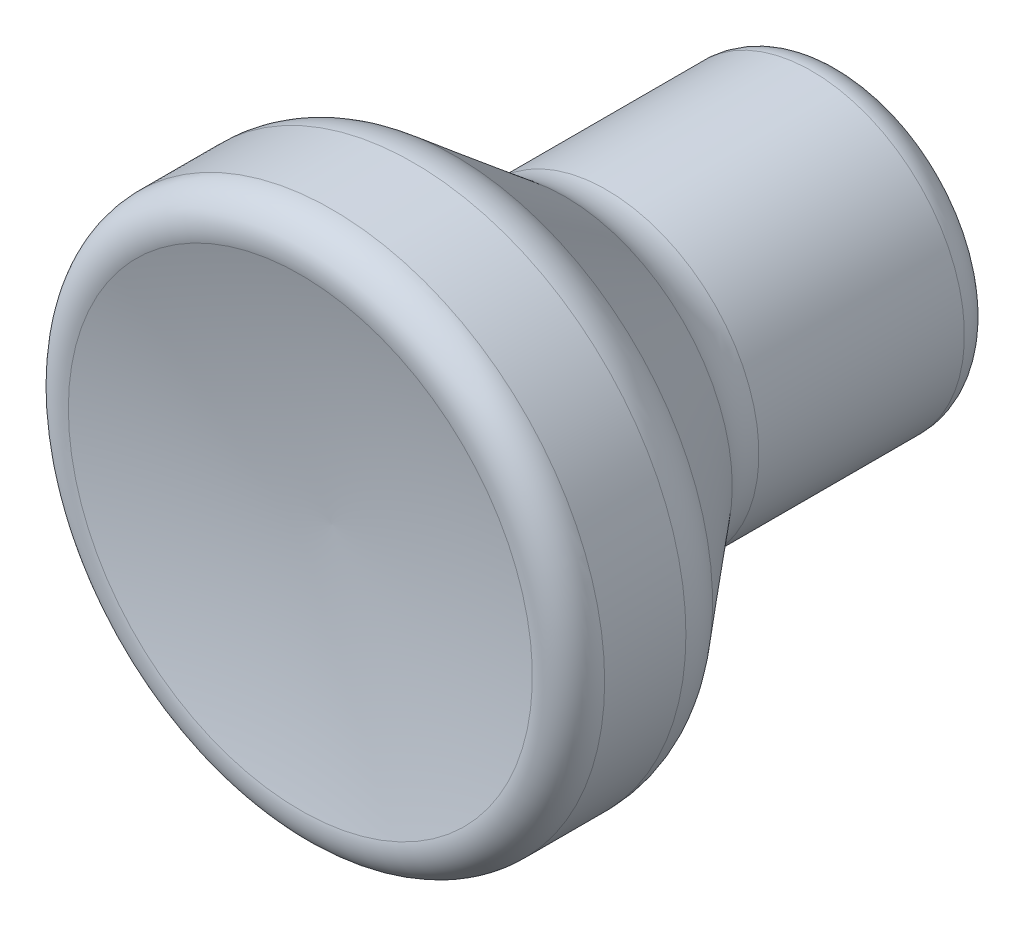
ISO-10303-21;
HEADER;
FILE_DESCRIPTION(('STEP AP214'),'2;1');
FILE_NAME('part.step','',(''),(''),'','','');
FILE_SCHEMA(('AUTOMOTIVE_DESIGN { 1 0 10303 214 1 1 1 1 }'));
ENDSEC;
DATA;
#1=APPLICATION_CONTEXT('core data for automotive mechanical design processes');
#2=APPLICATION_PROTOCOL_DEFINITION('international standard','automotive_design',2000,#1);
#3=PRODUCT_CONTEXT('',#1,'mechanical');
#4=PRODUCT('Part','Part','',(#3));
#5=PRODUCT_RELATED_PRODUCT_CATEGORY('part','',(#4));
#6=PRODUCT_DEFINITION_FORMATION('','',#4);
#7=PRODUCT_DEFINITION_CONTEXT('part definition',#1,'design');
#8=PRODUCT_DEFINITION('design','',#6,#7);
#9=PRODUCT_DEFINITION_SHAPE('','',#8);
#10=(LENGTH_UNIT() NAMED_UNIT(*) SI_UNIT(.MILLI.,.METRE.));
#11=(NAMED_UNIT(*) PLANE_ANGLE_UNIT() SI_UNIT($,.RADIAN.));
#12=(NAMED_UNIT(*) SI_UNIT($,.STERADIAN.) SOLID_ANGLE_UNIT());
#13=UNCERTAINTY_MEASURE_WITH_UNIT(LENGTH_MEASURE(1.E-05),#10,'distance_accuracy_value','');
#14=(GEOMETRIC_REPRESENTATION_CONTEXT(3) GLOBAL_UNCERTAINTY_ASSIGNED_CONTEXT((#13)) GLOBAL_UNIT_ASSIGNED_CONTEXT((#10,
#11,#12)) REPRESENTATION_CONTEXT('',''));
#15=CARTESIAN_POINT('',(0.,0.,0.));
#16=DIRECTION('',(0.,0.,1.));
#17=DIRECTION('',(1.,0.,0.));
#18=AXIS2_PLACEMENT_3D('',#15,#16,#17);
#19=CARTESIAN_POINT('',(0.000233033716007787,0.,23.5179137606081));
#20=DIRECTION('',(0.,0.,1.));
#21=DIRECTION('',(-1.,0.,0.));
#22=AXIS2_PLACEMENT_3D('',#19,#20,#21);
#23=CYLINDRICAL_SURFACE('',#22,3.);
#24=CARTESIAN_POINT('',(0.000233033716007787,0.,0.449887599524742));
#25=DIRECTION('',(0.,0.,-1.));
#26=DIRECTION('',(-1.,0.,0.));
#27=AXIS2_PLACEMENT_3D('',#24,#25,#26);
#28=CIRCLE('',#27,3.);
#29=CARTESIAN_POINT('',(-2.99976696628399,0.,0.449887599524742));
#30=VERTEX_POINT('',#29);
#31=EDGE_CURVE('E9',#30,#30,#28,.T.);
#32=ORIENTED_EDGE('',*,*,#31,.T.);
#33=EDGE_LOOP('',(#32));
#34=FACE_BOUND('',#33,.T.);
#35=CARTESIAN_POINT('',(0.000233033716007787,0.,9.99988759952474));
#36=DIRECTION('',(0.,0.,-1.));
#37=DIRECTION('',(-1.,0.,0.));
#38=AXIS2_PLACEMENT_3D('',#35,#36,#37);
#39=CIRCLE('',#38,3.);
#40=CARTESIAN_POINT('',(-2.99976696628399,0.,9.99988759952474));
#41=VERTEX_POINT('',#40);
#42=EDGE_CURVE('E105',#41,#41,#39,.T.);
#43=ORIENTED_EDGE('',*,*,#42,.F.);
#44=EDGE_LOOP('',(#43));
#45=FACE_BOUND('',#44,.T.);
#46=ADVANCED_FACE('F14',(#34,#45),#23,.F.);
#47=CARTESIAN_POINT('',(0.000233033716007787,0.,0.));
#48=DIRECTION('',(0.,0.,1.));
#49=DIRECTION('',(-1.,0.,0.));
#50=AXIS2_PLACEMENT_3D('',#47,#48,#49);
#51=CONICAL_SURFACE('',#50,5.49991569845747,1.57075136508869);
#52=CARTESIAN_POINT('',(0.000233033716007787,0.,-9.2168617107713E-05));
#53=DIRECTION('',(0.,0.,-1.));
#54=DIRECTION('',(-1.,0.,0.));
#55=AXIS2_PLACEMENT_3D('',#52,#53,#54);
#56=CIRCLE('',#55,3.44997976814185);
#57=CARTESIAN_POINT('',(-3.44974673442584,0.,-9.2168617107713E-05));
#58=VERTEX_POINT('',#57);
#59=EDGE_CURVE('E21',#58,#58,#56,.F.);
#60=ORIENTED_EDGE('',*,*,#59,.T.);
#61=EDGE_LOOP('',(#60));
#62=FACE_BOUND('',#61,.T.);
#63=CARTESIAN_POINT('',(0.000233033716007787,0.,0.));
#64=DIRECTION('',(0.,0.,1.));
#65=DIRECTION('',(-1.,0.,0.));
#66=AXIS2_PLACEMENT_3D('',#63,#64,#65);
#67=CIRCLE('',#66,5.49991569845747);
#68=CARTESIAN_POINT('',(-5.49968266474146,0.,0.));
#69=VERTEX_POINT('',#68);
#70=EDGE_CURVE('E102',#69,#69,#67,.T.);
#71=ORIENTED_EDGE('',*,*,#70,.F.);
#72=EDGE_LOOP('',(#71));
#73=FACE_BOUND('',#72,.T.);
#74=ADVANCED_FACE('F43',(#62,#73),#51,.T.);
#75=CARTESIAN_POINT('',(0.000233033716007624,0.,1.5));
#76=DIRECTION('',(0.,0.,1.));
#77=DIRECTION('',(-1.,0.,0.));
#78=AXIS2_PLACEMENT_3D('',#75,#76,#77);
#79=TOROIDAL_SURFACE('',#78,5.49991569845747,1.5);
#80=ORIENTED_EDGE('',*,*,#70,.T.);
#81=EDGE_LOOP('',(#80));
#82=FACE_BOUND('',#81,.T.);
#83=CARTESIAN_POINT('',(0.000233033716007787,0.,1.5));
#84=DIRECTION('',(0.,0.,1.));
#85=DIRECTION('',(-1.,0.,0.));
#86=AXIS2_PLACEMENT_3D('',#83,#84,#85);
#87=CIRCLE('',#86,6.99991569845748);
#88=CARTESIAN_POINT('',(-6.99968266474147,0.,1.5));
#89=VERTEX_POINT('',#88);
#90=EDGE_CURVE('E99',#89,#89,#87,.T.);
#91=ORIENTED_EDGE('',*,*,#90,.F.);
#92=EDGE_LOOP('',(#91));
#93=FACE_BOUND('',#92,.T.);
#94=ADVANCED_FACE('F49',(#82,#93),#79,.T.);
#95=CARTESIAN_POINT('',(0.000233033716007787,0.,23.5179137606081));
#96=DIRECTION('',(0.,0.,1.));
#97=DIRECTION('',(-1.,0.,0.));
#98=AXIS2_PLACEMENT_3D('',#95,#96,#97);
#99=CYLINDRICAL_SURFACE('',#98,6.99991569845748);
#100=ORIENTED_EDGE('',*,*,#90,.T.);
#101=EDGE_LOOP('',(#100));
#102=FACE_BOUND('',#101,.T.);
#103=CARTESIAN_POINT('',(0.000233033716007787,0.,10.9264));
#104=DIRECTION('',(0.,0.,1.));
#105=DIRECTION('',(-1.,0.,0.));
#106=AXIS2_PLACEMENT_3D('',#103,#104,#105);
#107=CIRCLE('',#106,6.99991569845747);
#108=CARTESIAN_POINT('',(-6.99968266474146,0.,10.9264));
#109=VERTEX_POINT('',#108);
#110=EDGE_CURVE('E96',#109,#109,#107,.T.);
#111=ORIENTED_EDGE('',*,*,#110,.F.);
#112=EDGE_LOOP('',(#111));
#113=FACE_BOUND('',#112,.T.);
#114=ADVANCED_FACE('F56',(#102,#113),#99,.T.);
#115=CARTESIAN_POINT('',(0.000233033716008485,0.,10.9263360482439));
#116=DIRECTION('',(0.,0.,1.));
#117=DIRECTION('',(-1.,0.,0.));
#118=AXIS2_PLACEMENT_3D('',#115,#116,#117);
#119=TOROIDAL_SURFACE('',#118,9.99992190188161,3.00000620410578);
#120=ORIENTED_EDGE('',*,*,#110,.T.);
#121=EDGE_LOOP('',(#120));
#122=FACE_BOUND('',#121,.T.);
#123=CARTESIAN_POINT('',(0.000233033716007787,0.,12.8298));
#124=DIRECTION('',(0.,0.,1.));
#125=DIRECTION('',(-1.,0.,0.));
#126=AXIS2_PLACEMENT_3D('',#123,#124,#125);
#127=CIRCLE('',#126,7.68111569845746);
#128=CARTESIAN_POINT('',(-7.68088266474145,0.,12.8298));
#129=VERTEX_POINT('',#128);
#130=EDGE_CURVE('E93',#129,#129,#127,.T.);
#131=ORIENTED_EDGE('',*,*,#130,.F.);
#132=EDGE_LOOP('',(#131));
#133=FACE_BOUND('',#132,.T.);
#134=ADVANCED_FACE('F60',(#122,#133),#119,.F.);
#135=CARTESIAN_POINT('',(0.000233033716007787,0.,17.8702153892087));
#136=DIRECTION('',(0.,0.,1.));
#137=DIRECTION('',(-1.,0.,0.));
#138=AXIS2_PLACEMENT_3D('',#135,#136,#137);
#139=CONICAL_SURFACE('',#138,11.8186969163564,0.687344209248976);
#140=ORIENTED_EDGE('',*,*,#130,.T.);
#141=EDGE_LOOP('',(#140));
#142=FACE_BOUND('',#141,.T.);
#143=CARTESIAN_POINT('',(0.000233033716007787,0.,17.8702153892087));
#144=DIRECTION('',(0.,0.,1.));
#145=DIRECTION('',(-1.,0.,0.));
#146=AXIS2_PLACEMENT_3D('',#143,#144,#145);
#147=CIRCLE('',#146,11.8186969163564);
#148=CARTESIAN_POINT('',(-11.8184638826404,0.,17.8702153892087));
#149=VERTEX_POINT('',#148);
#150=EDGE_CURVE('E87',#149,#149,#147,.T.);
#151=ORIENTED_EDGE('',*,*,#150,.F.);
#152=EDGE_LOOP('',(#151));
#153=FACE_BOUND('',#152,.T.);
#154=ADVANCED_FACE('F64',(#142,#153),#139,.T.);
#155=CARTESIAN_POINT('',(0.000233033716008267,0.,19.7737));
#156=DIRECTION('',(0.,0.,1.));
#157=DIRECTION('',(-1.,0.,0.));
#158=AXIS2_PLACEMENT_3D('',#155,#156,#157);
#159=TOROIDAL_SURFACE('',#158,9.49991569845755,2.99999999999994);
#160=ORIENTED_EDGE('',*,*,#150,.T.);
#161=EDGE_LOOP('',(#160));
#162=FACE_BOUND('',#161,.T.);
#163=CARTESIAN_POINT('',(0.000233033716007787,0.,19.7737));
#164=DIRECTION('',(0.,0.,1.));
#165=DIRECTION('',(-1.,0.,0.));
#166=AXIS2_PLACEMENT_3D('',#163,#164,#165);
#167=CIRCLE('',#166,12.4999156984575);
#168=CARTESIAN_POINT('',(-12.4996826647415,0.,19.7737));
#169=VERTEX_POINT('',#168);
#170=EDGE_CURVE('E81',#169,#169,#167,.T.);
#171=ORIENTED_EDGE('',*,*,#170,.F.);
#172=EDGE_LOOP('',(#171));
#173=FACE_BOUND('',#172,.T.);
#174=ADVANCED_FACE('F68',(#162,#173),#159,.T.);
#175=CARTESIAN_POINT('',(0.000233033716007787,0.,23.5179137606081));
#176=DIRECTION('',(0.,0.,1.));
#177=DIRECTION('',(-1.,0.,0.));
#178=AXIS2_PLACEMENT_3D('',#175,#176,#177);
#179=CYLINDRICAL_SURFACE('',#178,12.4999156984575);
#180=ORIENTED_EDGE('',*,*,#170,.T.);
#181=EDGE_LOOP('',(#180));
#182=FACE_BOUND('',#181,.T.);
#183=CARTESIAN_POINT('',(0.000233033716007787,0.,23.5));
#184=DIRECTION('',(0.,0.,1.));
#185=DIRECTION('',(-1.,0.,0.));
#186=AXIS2_PLACEMENT_3D('',#183,#184,#185);
#187=CIRCLE('',#186,12.4999156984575);
#188=CARTESIAN_POINT('',(-12.4996826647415,0.,23.5));
#189=VERTEX_POINT('',#188);
#190=EDGE_CURVE('E84',#189,#189,#187,.T.);
#191=ORIENTED_EDGE('',*,*,#190,.F.);
#192=EDGE_LOOP('',(#191));
#193=FACE_BOUND('',#192,.T.);
#194=ADVANCED_FACE('F38',(#182,#193),#179,.T.);
#195=CARTESIAN_POINT('',(0.000233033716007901,0.,23.5000989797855));
#196=DIRECTION('',(0.,0.,1.));
#197=DIRECTION('',(-1.,0.,0.));
#198=AXIS2_PLACEMENT_3D('',#195,#196,#197);
#199=TOROIDAL_SURFACE('',#198,11.0000273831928,1.49988831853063);
#200=ORIENTED_EDGE('',*,*,#190,.T.);
#201=EDGE_LOOP('',(#200));
#202=FACE_BOUND('',#201,.T.);
#203=CARTESIAN_POINT('',(0.000233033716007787,0.,24.9563009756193));
#204=DIRECTION('',(0.,0.,1.));
#205=DIRECTION('',(-1.,0.,0.));
#206=AXIS2_PLACEMENT_3D('',#203,#204,#205);
#207=CIRCLE('',#206,10.6406658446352);
#208=CARTESIAN_POINT('',(-10.6404328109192,0.,24.9563009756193));
#209=VERTEX_POINT('',#208);
#210=EDGE_CURVE('E85',#209,#209,#207,.T.);
#211=ORIENTED_EDGE('',*,*,#210,.F.);
#212=EDGE_LOOP('',(#211));
#213=FACE_BOUND('',#212,.T.);
#214=ADVANCED_FACE('F27',(#202,#213),#199,.T.);
#215=CARTESIAN_POINT('',(1.33914556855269,0.,73.499785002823));
#216=DIRECTION('',(0.,1.,0.));
#217=DIRECTION('',(-1.,0.,0.));
#218=AXIS2_PLACEMENT_3D('',#215,#216,#217);
#219=CIRCLE('',#218,49.9998013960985);
#220=TRIMMED_CURVE('',#219,(PARAMETER_VALUE(-1.54401476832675)),
(PARAMETER_VALUE(1.54401476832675)),.T.,.PARAMETER.);
#221=CARTESIAN_POINT('',(0.000233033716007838,0.,73.499785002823));
#222=DIRECTION('',(0.,0.,1.));
#223=AXIS1_PLACEMENT('',#221,#222);
#224=SURFACE_OF_REVOLUTION('',#220,#223);
#225=ORIENTED_EDGE('',*,*,#210,.T.);
#226=EDGE_LOOP('',(#225));
#227=FACE_BOUND('',#226,.T.);
#228=CARTESIAN_POINT('',(0.000233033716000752,0.,23.5179137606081));
#229=VERTEX_POINT('',#228);
#230=VERTEX_LOOP('',#229);
#231=FACE_BOUND('',#230,.T.);
#232=ADVANCED_FACE('F24',(#227,#231),#224,.F.);
#233=CARTESIAN_POINT('',(0.000233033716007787,0.,9.99988759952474));
#234=DIRECTION('',(0.,0.,-1.));
#235=DIRECTION('',(-1.,0.,0.));
#236=AXIS2_PLACEMENT_3D('',#233,#234,#235);
#237=PLANE('',#236);
#238=ORIENTED_EDGE('',*,*,#42,.T.);
#239=EDGE_LOOP('',(#238));
#240=FACE_BOUND('',#239,.T.);
#241=ADVANCED_FACE('F26',(#240),#237,.T.);
#242=CARTESIAN_POINT('',(0.000233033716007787,0.,-9.2168617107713E-05));
#243=DIRECTION('',(0.,0.,-1.));
#244=DIRECTION('',(-1.,0.,0.));
#245=AXIS2_PLACEMENT_3D('',#242,#243,#244);
#246=CONICAL_SURFACE('',#245,3.44997976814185,0.785398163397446);
#247=ORIENTED_EDGE('',*,*,#31,.F.);
#248=EDGE_LOOP('',(#247));
#249=FACE_BOUND('',#248,.T.);
#250=ORIENTED_EDGE('',*,*,#59,.F.);
#251=EDGE_LOOP('',(#250));
#252=FACE_BOUND('',#251,.T.);
#253=ADVANCED_FACE('F16',(#249,#252),#246,.F.);
#254=CLOSED_SHELL('',(#46,#74,#94,#114,#134,#154,#174,#194,#214,#232,#241,#253));
#255=MANIFOLD_SOLID_BREP('B1',#254);
#256=ADVANCED_BREP_SHAPE_REPRESENTATION('',(#18,#255),#14);
#257=SHAPE_DEFINITION_REPRESENTATION(#9,#256);
ENDSEC;
END-ISO-10303-21;
